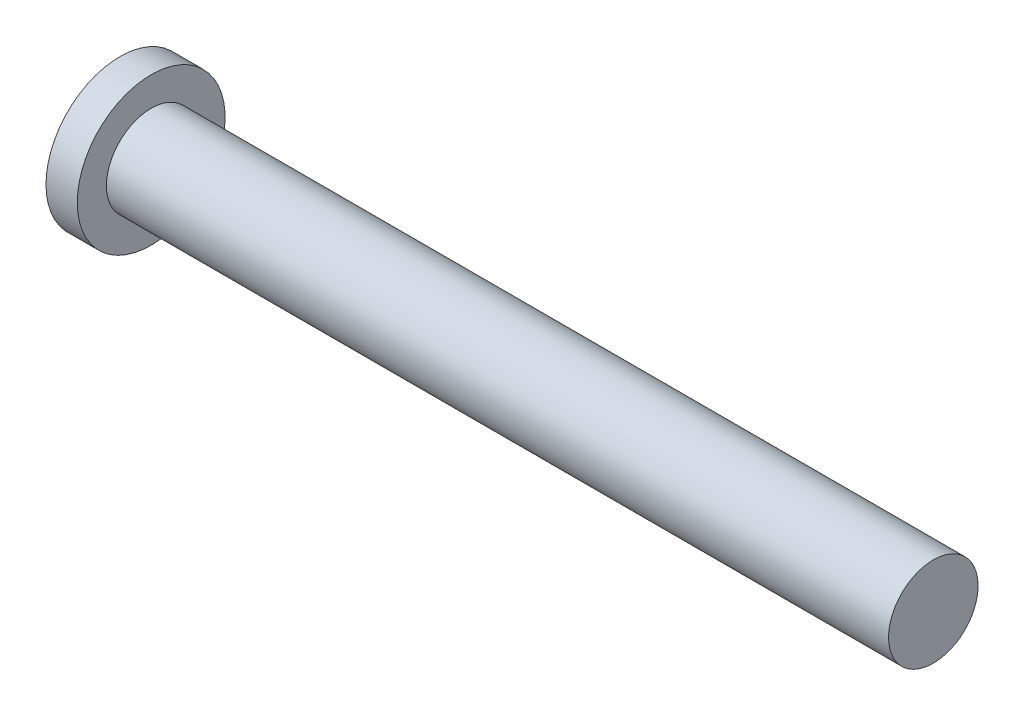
from build123d import *

# Parameters (mm, degrees)
SKETCH1_W = 152.4
SKETCH1_H = 1.5875


with BuildPart() as part:
    # Sketch1 → Revolve1 (revolve)
    with BuildSketch(Plane(origin=(0, 0, 0), x_dir=(1, 0, 0), z_dir=(0, 1, 0)), mode=Mode.PRIVATE) as revolve1_sk:
        Polygon((158.75, 7.5), (158.75, 0), (165.1, 0), (165.1, 9.0875), (158.75, 9.0875), align=None)
        Polygon((0, 15), (0, 0), (6.35, 0), (6.35, 7.5), (6.35, 9.0875), (6.35, 15), align=None)
        with Locations((82.55, 8.29375)):
            Rectangle(SKETCH1_W, SKETCH1_H)
    revolve(revolve1_sk.sketch.rotate(Axis((0, 0, 0), (1, 0, 0)), 180), axis=Axis((0, 0, 0), (1, 0, 0)))


solid = part.part
